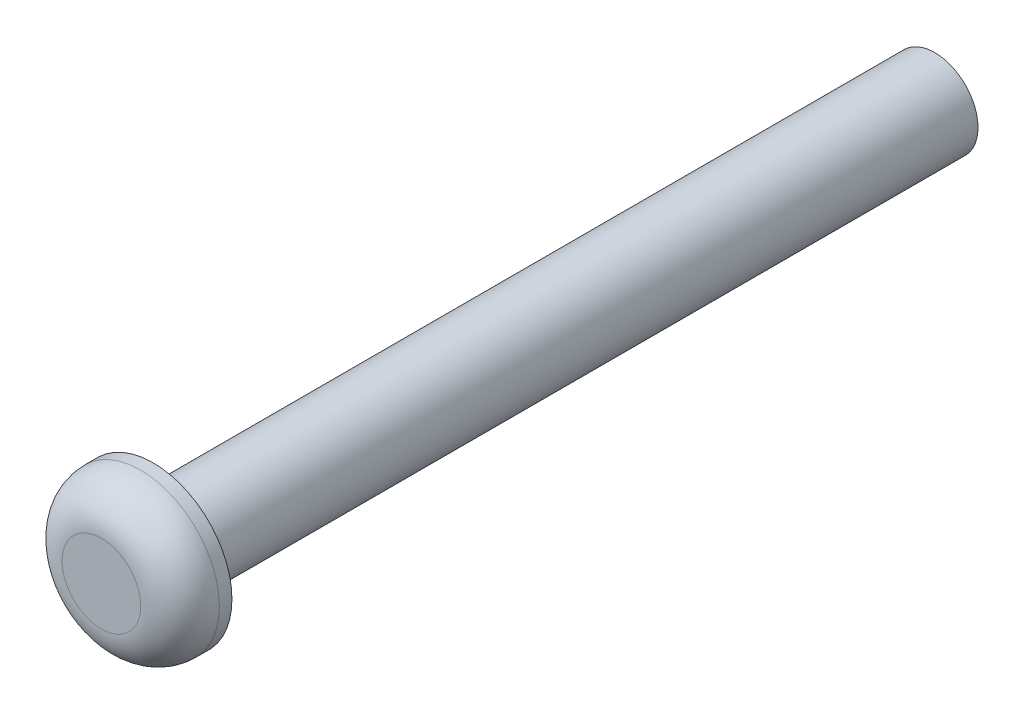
ISO-10303-21;
HEADER;
FILE_DESCRIPTION(('STEP AP214'),'2;1');
FILE_NAME('part.step','',(''),(''),'','','');
FILE_SCHEMA(('AUTOMOTIVE_DESIGN { 1 0 10303 214 1 1 1 1 }'));
ENDSEC;
DATA;
#1=APPLICATION_CONTEXT('core data for automotive mechanical design processes');
#2=APPLICATION_PROTOCOL_DEFINITION('international standard','automotive_design',2000,#1);
#3=PRODUCT_CONTEXT('',#1,'mechanical');
#4=PRODUCT('Part','Part','',(#3));
#5=PRODUCT_RELATED_PRODUCT_CATEGORY('part','',(#4));
#6=PRODUCT_DEFINITION_FORMATION('','',#4);
#7=PRODUCT_DEFINITION_CONTEXT('part definition',#1,'design');
#8=PRODUCT_DEFINITION('design','',#6,#7);
#9=PRODUCT_DEFINITION_SHAPE('','',#8);
#10=(LENGTH_UNIT() NAMED_UNIT(*) SI_UNIT(.MILLI.,.METRE.));
#11=(NAMED_UNIT(*) PLANE_ANGLE_UNIT() SI_UNIT($,.RADIAN.));
#12=(NAMED_UNIT(*) SI_UNIT($,.STERADIAN.) SOLID_ANGLE_UNIT());
#13=UNCERTAINTY_MEASURE_WITH_UNIT(LENGTH_MEASURE(1.E-05),#10,'distance_accuracy_value','');
#14=(GEOMETRIC_REPRESENTATION_CONTEXT(3) GLOBAL_UNCERTAINTY_ASSIGNED_CONTEXT((#13)) GLOBAL_UNIT_ASSIGNED_CONTEXT((#10,
#11,#12)) REPRESENTATION_CONTEXT('',''));
#15=CARTESIAN_POINT('',(0.,0.,0.));
#16=DIRECTION('',(0.,0.,1.));
#17=DIRECTION('',(1.,0.,0.));
#18=AXIS2_PLACEMENT_3D('',#15,#16,#17);
#19=CARTESIAN_POINT('',(0.,0.,1.6764));
#20=DIRECTION('',(0.,0.,-1.));
#21=DIRECTION('',(-1.,0.,0.));
#22=AXIS2_PLACEMENT_3D('',#19,#20,#21);
#23=CYLINDRICAL_SURFACE('',#22,2.54);
#24=CARTESIAN_POINT('',(0.,0.,0.4064));
#25=DIRECTION('',(0.,0.,1.));
#26=DIRECTION('',(1.,0.,0.));
#27=AXIS2_PLACEMENT_3D('',#24,#25,#26);
#28=CIRCLE('',#27,2.54);
#29=CARTESIAN_POINT('',(2.54,0.,0.4064));
#30=VERTEX_POINT('',#29);
#31=EDGE_CURVE('E10',#30,#30,#28,.F.);
#32=ORIENTED_EDGE('',*,*,#31,.T.);
#33=EDGE_LOOP('',(#32));
#34=FACE_BOUND('',#33,.T.);
#35=CARTESIAN_POINT('',(0.,0.,0.));
#36=DIRECTION('',(0.,0.,1.));
#37=DIRECTION('',(1.,0.,0.));
#38=AXIS2_PLACEMENT_3D('',#35,#36,#37);
#39=CIRCLE('',#38,2.54);
#40=CARTESIAN_POINT('',(2.54,0.,0.));
#41=VERTEX_POINT('',#40);
#42=EDGE_CURVE('E42',#41,#41,#39,.T.);
#43=ORIENTED_EDGE('',*,*,#42,.T.);
#44=EDGE_LOOP('',(#43));
#45=FACE_BOUND('',#44,.T.);
#46=ADVANCED_FACE('F31',(#34,#45),#23,.T.);
#47=CARTESIAN_POINT('',(0.,0.,1.6764));
#48=DIRECTION('',(0.,0.,1.));
#49=DIRECTION('',(1.,0.,0.));
#50=AXIS2_PLACEMENT_3D('',#47,#48,#49);
#51=PLANE('',#50);
#52=CARTESIAN_POINT('',(0.,0.,1.6764));
#53=DIRECTION('',(0.,0.,1.));
#54=DIRECTION('',(1.,0.,0.));
#55=AXIS2_PLACEMENT_3D('',#52,#53,#54);
#56=CIRCLE('',#55,1.27);
#57=CARTESIAN_POINT('',(1.27,0.,1.6764));
#58=VERTEX_POINT('',#57);
#59=EDGE_CURVE('E38',#58,#58,#56,.T.);
#60=ORIENTED_EDGE('',*,*,#59,.T.);
#61=EDGE_LOOP('',(#60));
#62=FACE_BOUND('',#61,.T.);
#63=ADVANCED_FACE('F69',(#62),#51,.T.);
#64=CARTESIAN_POINT('',(0.,0.,0.));
#65=DIRECTION('',(0.,0.,1.));
#66=DIRECTION('',(1.,0.,0.));
#67=AXIS2_PLACEMENT_3D('',#64,#65,#66);
#68=PLANE('',#67);
#69=CARTESIAN_POINT('',(0.,0.,0.));
#70=DIRECTION('',(0.,0.,1.));
#71=DIRECTION('',(1.,0.,0.));
#72=AXIS2_PLACEMENT_3D('',#69,#70,#71);
#73=CIRCLE('',#72,1.397);
#74=CARTESIAN_POINT('',(1.397,0.,0.));
#75=VERTEX_POINT('',#74);
#76=EDGE_CURVE('E46',#75,#75,#73,.T.);
#77=ORIENTED_EDGE('',*,*,#76,.T.);
#78=EDGE_LOOP('',(#77));
#79=FACE_BOUND('',#78,.T.);
#80=ORIENTED_EDGE('',*,*,#42,.F.);
#81=EDGE_LOOP('',(#80));
#82=FACE_BOUND('',#81,.T.);
#83=ADVANCED_FACE('F66',(#79,#82),#68,.F.);
#84=CARTESIAN_POINT('',(0.,0.,-25.2476));
#85=DIRECTION('',(0.,0.,1.));
#86=DIRECTION('',(1.,0.,0.));
#87=AXIS2_PLACEMENT_3D('',#84,#85,#86);
#88=CYLINDRICAL_SURFACE('',#87,1.397);
#89=CARTESIAN_POINT('',(0.,0.,-25.2476));
#90=DIRECTION('',(0.,0.,1.));
#91=DIRECTION('',(1.,0.,0.));
#92=AXIS2_PLACEMENT_3D('',#89,#90,#91);
#93=CIRCLE('',#92,1.397);
#94=CARTESIAN_POINT('',(1.397,0.,-25.2476));
#95=VERTEX_POINT('',#94);
#96=EDGE_CURVE('E50',#95,#95,#93,.T.);
#97=ORIENTED_EDGE('',*,*,#96,.T.);
#98=EDGE_LOOP('',(#97));
#99=FACE_BOUND('',#98,.T.);
#100=ORIENTED_EDGE('',*,*,#76,.F.);
#101=EDGE_LOOP('',(#100));
#102=FACE_BOUND('',#101,.T.);
#103=ADVANCED_FACE('F55',(#99,#102),#88,.T.);
#104=CARTESIAN_POINT('',(0.,0.,-25.2476));
#105=DIRECTION('',(0.,0.,1.));
#106=DIRECTION('',(1.,0.,0.));
#107=AXIS2_PLACEMENT_3D('',#104,#105,#106);
#108=PLANE('',#107);
#109=ORIENTED_EDGE('',*,*,#96,.F.);
#110=EDGE_LOOP('',(#109));
#111=FACE_BOUND('',#110,.T.);
#112=ADVANCED_FACE('F58',(#111),#108,.F.);
#113=CARTESIAN_POINT('',(0.,0.,0.4064));
#114=DIRECTION('',(0.,0.,1.));
#115=DIRECTION('',(1.,0.,0.));
#116=AXIS2_PLACEMENT_3D('',#113,#114,#115);
#117=DEGENERATE_TOROIDAL_SURFACE('',#116,1.27,1.27,.T.);
#118=ORIENTED_EDGE('',*,*,#31,.F.);
#119=EDGE_LOOP('',(#118));
#120=FACE_BOUND('',#119,.T.);
#121=ORIENTED_EDGE('',*,*,#59,.F.);
#122=EDGE_LOOP('',(#121));
#123=FACE_BOUND('',#122,.T.);
#124=ADVANCED_FACE('F33',(#120,#123),#117,.T.);
#125=CLOSED_SHELL('',(#46,#63,#83,#103,#112,#124));
#126=MANIFOLD_SOLID_BREP('B2',#125);
#127=ADVANCED_BREP_SHAPE_REPRESENTATION('',(#18,#126),#14);
#128=SHAPE_DEFINITION_REPRESENTATION(#9,#127);
ENDSEC;
END-ISO-10303-21;
